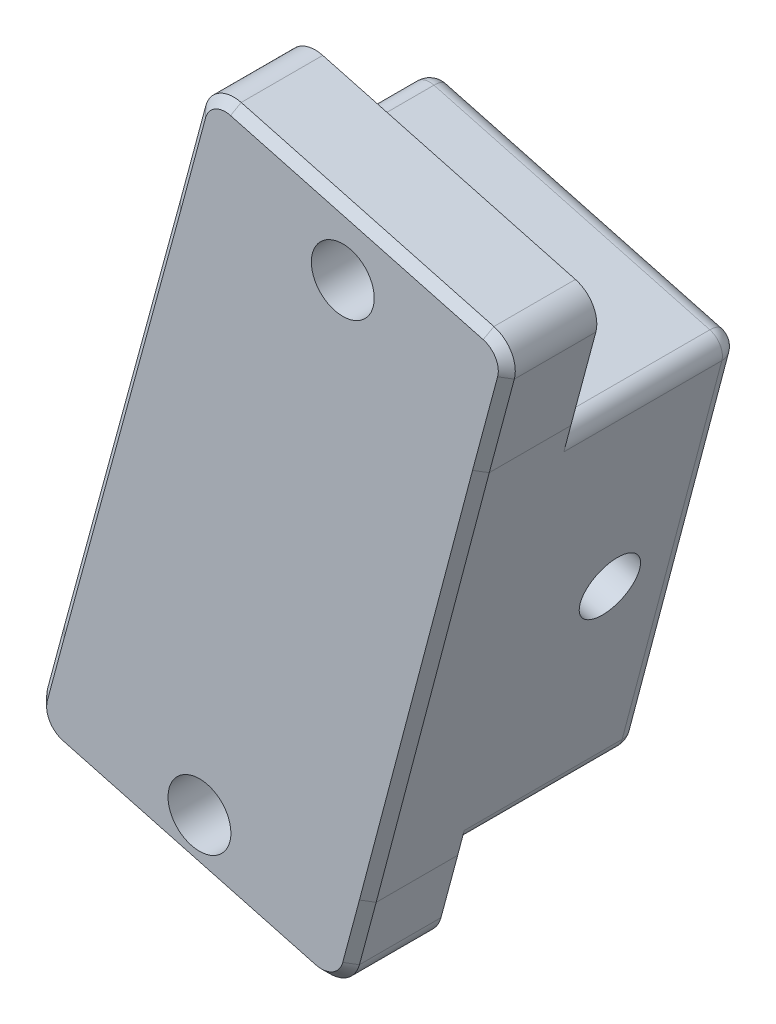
from build123d import *

# Parameters (mm, degrees)
SKETCH1_R           = 0.9250000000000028
BOSS_EXTRUDE1_DEPTH = 2.65
BOSS_EXTRUDE2_DEPTH = 5.15
CHAMFER2_SIZE       = 0.25
FILLET1_R           = 0.5
SKETCH3_R           = 0.875000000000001
CUT_EXTRUDE1_DEPTH  = 10


with BuildPart() as part:
    # Sketch1 → Boss-Extrude1 (new body)
    with BuildSketch(Plane.XY):
        with BuildLine():
            Line((63.391891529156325, -37.72229332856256), (55.954262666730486, -35.729386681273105))
            ThreePointArc((55.954262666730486, -35.729386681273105), (55.30926647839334, -35.81430204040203), (54.91322952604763, -36.330427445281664))
            Line((54.91322952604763, -36.330427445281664), (54.175595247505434, -39.08331605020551))
            Line((54.175595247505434, -39.08331605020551), (50.74971041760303, -51.67570713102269))
            Line((50.74971041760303, -51.67570713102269), (50.25795423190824, -53.51096620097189))
            ThreePointArc((50.25795423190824, -53.51096620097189), (50.347864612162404, -54.19390334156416), (50.894350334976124, -54.61323658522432))
            Line((50.894350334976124, -54.61323658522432), (58.33197919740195, -56.60614323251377))
            ThreePointArc((58.33197919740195, -56.60614323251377), (59.014916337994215, -56.51623285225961), (59.434249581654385, -55.9697471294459))
            Line((59.434249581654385, -55.9697471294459), (59.92600576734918, -54.13448805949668))
            Line((59.92600576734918, -54.13448805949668), (63.255298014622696, -41.51621507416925))
            Line((63.255298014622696, -41.51621507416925), (63.992932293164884, -38.76332646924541))
            ThreePointArc((63.992932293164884, -38.76332646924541), (63.908016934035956, -38.11833028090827), (63.391891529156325, -37.72229332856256))
        make_face()
        with Locations(Location((54.97551142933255, -54.25739375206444, 0), (0, 0, 270))):
            Circle(SKETCH1_R, mode=Mode.SUBTRACT)
        with Locations(Location((59.194261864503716, -38.512802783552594, 0), (0, 0, 270))):
            Circle(SKETCH1_R, mode=Mode.SUBTRACT)
    extrude(amount=BOSS_EXTRUDE1_DEPTH)

    # Sketch2 → Boss-Extrude2 (add)
    with BuildSketch(Plane(origin=(0, 0, 0), x_dir=(-1, 0, 0), z_dir=(0, 0, -1))):
        Polygon((-59.9897853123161, -53.89275869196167), (-50.81534039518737, -51.43447358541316), (-54.09683927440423, -39.37279630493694), (-63.17876256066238, -41.806290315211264), align=None)
    extrude(amount=BOSS_EXTRUDE2_DEPTH)

    # Chamfer2
    chamfer2_edges = [part.edges().sort_by_distance(p)[0] for p in [
        (63.62411515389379, -40.13977077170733, 2.65),
        (54.544412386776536, -37.70687174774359, 2.65),
        (63.908016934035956, -38.11833028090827, 2.65),
        (55.30926647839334, -35.81430204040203, 2.65),
        (59.673077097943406, -36.72584000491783, 2.65),
        (50.503832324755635, -52.59333666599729, 2.65),
        (59.68012767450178, -55.05211759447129, 2.65),
        (50.347864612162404, -54.19390334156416, 2.65),
        (59.014916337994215, -56.51623285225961, 2.65),
        (54.61316476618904, -55.60968990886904, 2.65),
    ]]
    chamfer(chamfer2_edges, length=CHAMFER2_SIZE)

    # Fillet1
    fillet1_edges = [part.edges().sort_by_distance(p)[0] for p in [
        (63.17876256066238, -41.806290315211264, -2.575),
        (59.9897853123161, -53.89275869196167, -2.575),
        (50.81534039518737, -51.43447358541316, -2.575),
        (54.09683927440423, -39.37279630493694, -2.575),
        (61.58427393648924, -47.849524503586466, -5.15),
        (55.40256285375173, -52.663616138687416, -5.15),
        (52.456089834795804, -45.40363494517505, -5.15),
        (58.637800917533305, -40.589543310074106, -5.15),
    ]]
    fillet(fillet1_edges, radius=FILLET1_R)

    # Sketch3 → Cut-Extrude1 (cut)
    with BuildSketch(Plane(origin=(69.3793652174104, -18.305530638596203, 0), x_dir=(0, 0, -1), z_dir=(0.9669103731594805, -0.2551163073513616, 0))):
        with Locations(Location((2.8250000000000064, -30.56778803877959, 0), (0, 0, 90))):
            Circle(SKETCH3_R)
    extrude(amount=-CUT_EXTRUDE1_DEPTH, mode=Mode.SUBTRACT)


solid = part.part
